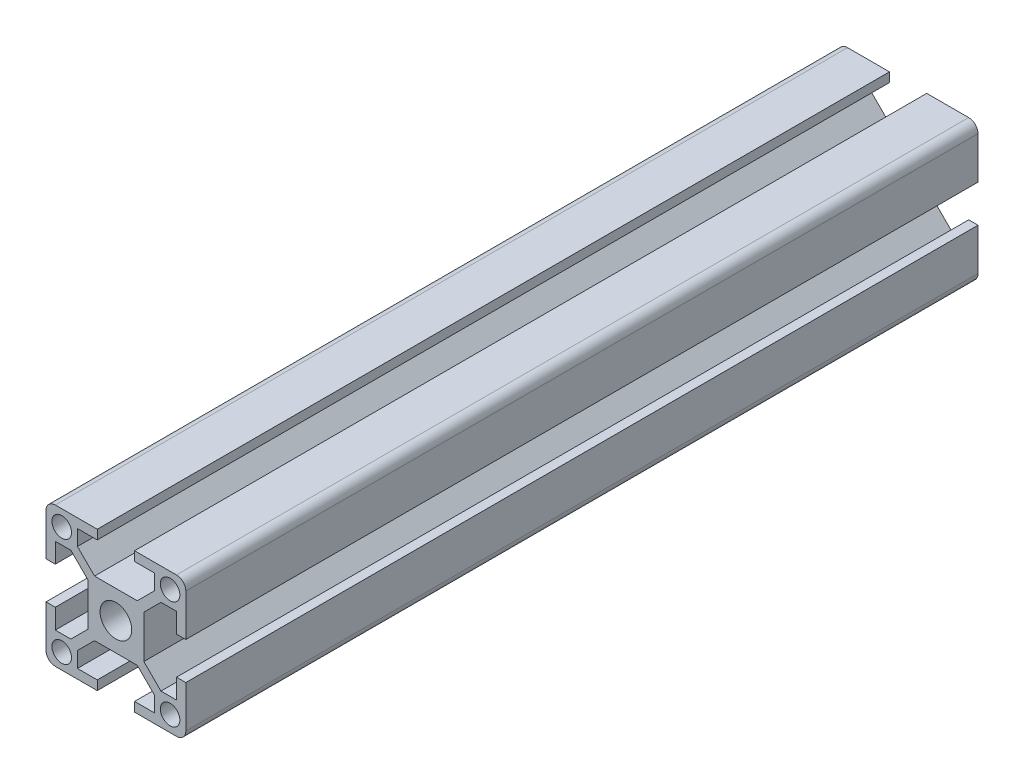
from build123d import *

# Parameters (mm, degrees)
SKETCH_1_R      = 2.1
SKETCH_1_R_2    = 3.4
EXTRUDE_1_DEPTH = 170


with BuildPart() as part:
    # Sketch 1 → Extrude 1 (new body)
    with BuildSketch(Plane.XY):
        with BuildLine():
            Line((-15, -4), (-15, -13))
            ThreePointArc((-15, -13), (-14.414213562, -14.414213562), (-13, -15))
            Line((-13, -15), (-4, -15))
            Line((-4, -15), (-4, -13))
            Line((-4, -13), (-8.25, -13))
            Line((-8.25, -13), (-8.25, -9.664213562))
            Line((-8.25, -9.664213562), (-4.585786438, -6))
            Line((-4.585786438, -6), (4.585786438, -6))
            Line((4.585786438, -6), (8.25, -9.664213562))
            Line((8.25, -9.664213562), (8.25, -13))
            Line((8.25, -13), (4, -13))
            Line((4, -13), (4, -15))
            Line((4, -15), (13, -15))
            ThreePointArc((13, -15), (14.414213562, -14.414213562), (15, -13))
            Line((15, -13), (15, -4))
            Line((15, -4), (13, -4))
            Line((13, -4), (13, -8.25))
            Line((13, -8.25), (9.664213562, -8.25))
            Line((9.664213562, -8.25), (6, -4.585786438))
            Line((6, -4.585786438), (6, 4.585786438))
            Line((6, 4.585786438), (9.664213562, 8.25))
            Line((9.664213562, 8.25), (13, 8.25))
            Line((13, 8.25), (13, 4))
            Line((13, 4), (15, 4))
            Line((15, 4), (15, 13))
            ThreePointArc((15, 13), (14.414213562, 14.414213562), (13, 15))
            Line((13, 15), (4, 15))
            Line((4, 15), (4, 13))
            Line((4, 13), (8.25, 13))
            Line((8.25, 13), (8.25, 9.664213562))
            Line((8.25, 9.664213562), (4.585786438, 6))
            Line((4.585786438, 6), (-4.585786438, 6))
            Line((-4.585786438, 6), (-8.25, 9.664213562))
            Line((-8.25, 9.664213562), (-8.25, 13))
            Line((-8.25, 13), (-4, 13))
            Line((-4, 13), (-4, 15))
            Line((-4, 15), (-13, 15))
            ThreePointArc((-13, 15), (-14.414213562, 14.414213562), (-15, 13))
            Line((-15, 13), (-15, 4))
            Line((-15, 4), (-13, 4))
            Line((-13, 4), (-13, 8.25))
            Line((-13, 8.25), (-9.664213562, 8.25))
            Line((-9.664213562, 8.25), (-6, 4.585786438))
            Line((-6, 4.585786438), (-6, -4.585786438))
            Line((-6, -4.585786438), (-9.664213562, -8.25))
            Line((-9.664213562, -8.25), (-13, -8.25))
            Line((-13, -8.25), (-13, -4))
            Line((-13, -4), (-15, -4))
        make_face()
        with Locations((11.625, 11.625)):
            Circle(SKETCH_1_R, mode=Mode.SUBTRACT)
        with Locations((-11.625, 11.625)):
            Circle(SKETCH_1_R, mode=Mode.SUBTRACT)
        with Locations(Location((-11.625, -11.625, 0), (0, 0, 180))):
            Circle(SKETCH_1_R, mode=Mode.SUBTRACT)
        with Locations(Location((11.625, -11.625, 0), (0, 0, 180))):
            Circle(SKETCH_1_R, mode=Mode.SUBTRACT)
        Circle(SKETCH_1_R_2, mode=Mode.SUBTRACT)
    extrude(amount=EXTRUDE_1_DEPTH)


solid = part.part
